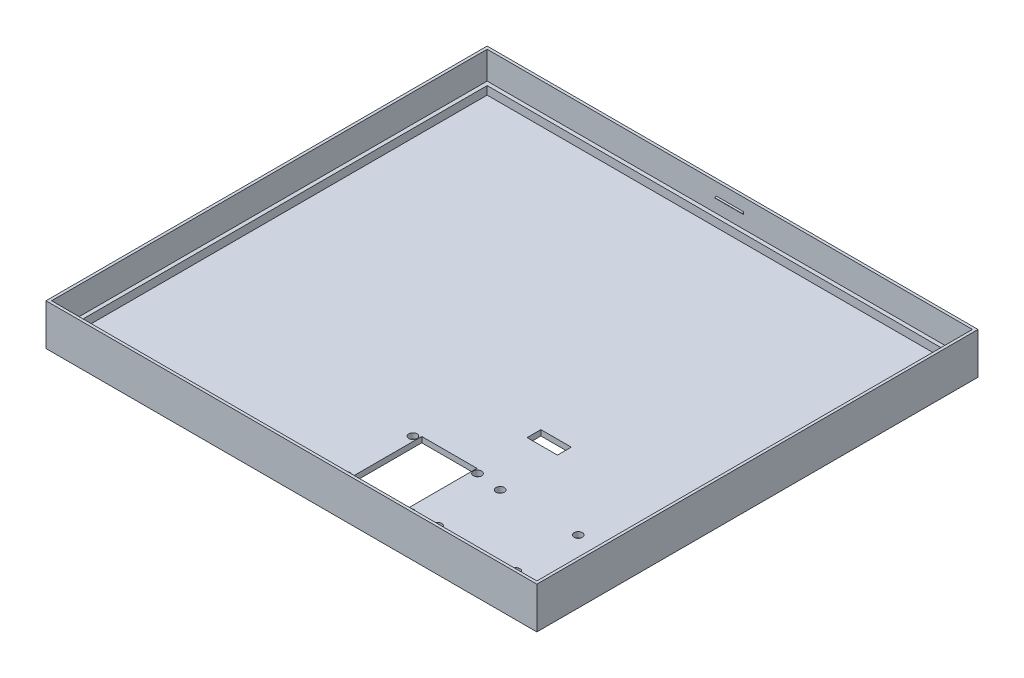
from build123d import *

# Parameters (mm, degrees)
SKETCH_1_W          = 177.8
SKETCH_1_H          = 159.8
EXTRUDE_1_DEPTH     = 15
SKETCH_3_W          = 173
SKETCH_3_H          = 155
CUT_EXTRUDE_1_DEPTH = 13
SKETCH_5_W          = 175.8
SKETCH_5_H          = 157.8
CUT_EXTRUDE_2_DEPTH = 10
EXTRUDE_2_DEPTH     = 5
FILLET_11_R         = 0.1
FILLET_12_R         = 0.1
SKETCH_12_W         = 20
SKETCH_12_H         = 27.3
SKETCH_12_R         = 1.5
CUT_EXTRUDE_4_DEPTH = 2
SKETCH_14_R         = 1.5
CUT_EXTRUDE_5_DEPTH = 2
SKETCH_15_W         = 3
SKETCH_15_H         = 16
CUT_EXTRUDE_6_DEPTH = 2
SKETCH_16_W         = 11
SKETCH_16_H         = 5
CUT_EXTRUDE_7_DEPTH = 2


with BuildPart() as part:
    # Sketch 1 → Extrude 1 (new body)
    with BuildSketch(Plane(origin=(0, 0, 0), x_dir=(1, 0, 0), z_dir=(0, 1, 0))):
        with Locations((88.9, 79.9)):
            Rectangle(SKETCH_1_W, SKETCH_1_H)
    extrude(amount=EXTRUDE_1_DEPTH)

    # Sketch 3 → Cut-Extrude 1 (cut)
    with BuildSketch(Plane(origin=(0, 15, 0), x_dir=(1, 0, 0), z_dir=(0, 1, 0))):
        with Locations((88.9, 79.9)):
            Rectangle(SKETCH_3_W, SKETCH_3_H)
    extrude(amount=-CUT_EXTRUDE_1_DEPTH, mode=Mode.SUBTRACT)

    # Sketch 5 → Cut-Extrude 2 (cut)
    with BuildSketch(Plane(origin=(0, 15, 0), x_dir=(1, 0, 0), z_dir=(0, 1, 0))):
        with Locations((88.9, 79.9)):
            Rectangle(SKETCH_5_W, SKETCH_5_H)
    extrude(amount=-CUT_EXTRUDE_2_DEPTH, mode=Mode.SUBTRACT)

    # Sketch 7 → Extrude 2 (add, symmetric)
    with BuildSketch(Plane.ZY.offset(-88.9)):
        Polygon((-158.8, 10), (-158.8, 9.56), (-158.36, 10), (-158.8, 10.44), align=None)
    extrude_2 = extrude(amount=EXTRUDE_2_DEPTH, both=True)

    # Fillet 11
    fillet_11_edges = [part.edges().sort_by_distance(p)[0] for p in [
        (88.9, 10, -158.36),
    ]]
    fillet(fillet_11_edges, radius=FILLET_11_R)

    # Mirror 1: Extrude 2 across plane
    add(extrude_2.mirror(Plane.XY.offset(-79.9)))

    # Fillet 12
    fillet_12_edges = [part.edges().sort_by_distance(p)[0] for p in [
        (88.9, 10, -1.44),
    ]]
    fillet(fillet_12_edges, radius=FILLET_12_R)

    # Sketch 12 → Cut-Extrude 4 (cut)
    with BuildSketch(Plane.XZ):
        with Locations((107.629127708, -24.830840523)):
            Rectangle(SKETCH_12_W, SKETCH_12_H)
        with Locations(Location((119.329127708, -36.980840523, 0), (0, 0, 270))):
            Circle(SKETCH_12_R)
        with Locations(Location((95.929127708, -12.680840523, 0), (0, 0, 270))):
            Circle(SKETCH_12_R)
        with Locations(Location((95.929127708, -36.980840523, 0), (0, 0, 270))):
            Circle(SKETCH_12_R)
        with Locations(Location((119.329127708, -12.680840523, 0), (0, 0, 270))):
            Circle(SKETCH_12_R)
    extrude(amount=-CUT_EXTRUDE_4_DEPTH, mode=Mode.SUBTRACT)

    # Sketch 14 → Cut-Extrude 5 (cut)
    with BuildSketch(Plane.XZ):
        with Locations(Location((128.582102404, -35.916610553, 0), (0, 0, 270))):
            Circle(SKETCH_14_R)
        with Locations(Location((128.582102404, -13.316610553, 0), (0, 0, 270))):
            Circle(SKETCH_14_R)
        with Locations(Location((156.882102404, -35.916610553, 0), (0, 0, 270))):
            Circle(SKETCH_14_R)
        with Locations(Location((156.882102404, -13.316610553, 0), (0, 0, 270))):
            Circle(SKETCH_14_R)
    extrude(amount=-CUT_EXTRUDE_5_DEPTH, mode=Mode.SUBTRACT)

    # Sketch 15 → Cut-Extrude 6 (cut)
    with BuildSketch(Plane.XZ):
        with Locations((168.440434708, -24.436335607)):
            Rectangle(SKETCH_15_W, SKETCH_15_H)
    extrude(amount=-CUT_EXTRUDE_6_DEPTH, mode=Mode.SUBTRACT)

    # Sketch 16 → Cut-Extrude 7 (cut)
    with BuildSketch(Plane.XZ):
        with Locations((122.560137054, -59.70952242)):
            Rectangle(SKETCH_16_W, SKETCH_16_H)
    extrude(amount=-CUT_EXTRUDE_7_DEPTH, mode=Mode.SUBTRACT)


solid = part.part
